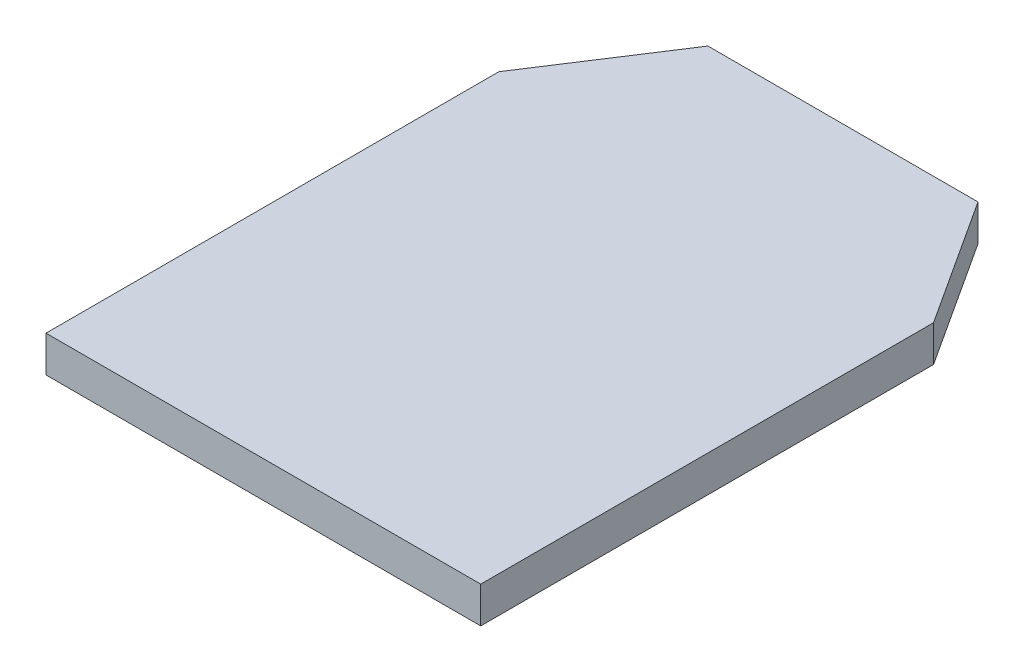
from build123d import *

# Parameters (mm, degrees)
EXTRUSION1_DEPTH = 10


with BuildPart() as part:
    # Esquisse1 → Extrusion1 (new body)
    with BuildSketch(Plane(origin=(0, 0, 0), x_dir=(1, 0, 0), z_dir=(0, 1, 0))):
        Polygon((-37.270734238, 45), (37.270734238, 45), (60, 10), (60, -115), (-60, -115), (-60, 10), align=None)
    extrude(amount=EXTRUSION1_DEPTH)


solid = part.part
